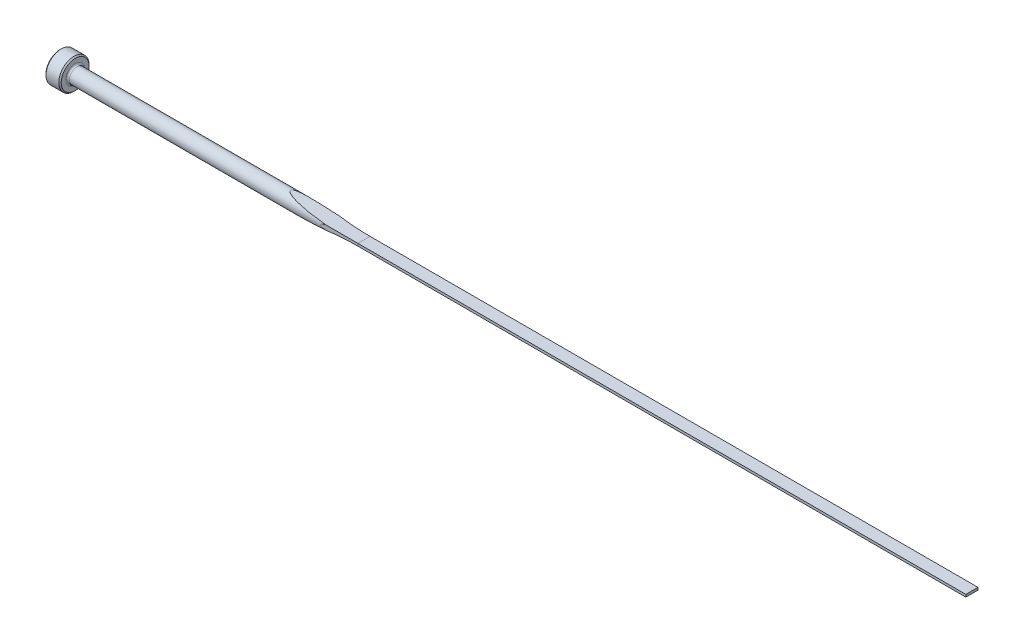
ISO-10303-21;
HEADER;
FILE_DESCRIPTION(('STEP AP214'),'2;1');
FILE_NAME('part.step','',(''),(''),'','','');
FILE_SCHEMA(('AUTOMOTIVE_DESIGN { 1 0 10303 214 1 1 1 1 }'));
ENDSEC;
DATA;
#1=APPLICATION_CONTEXT('core data for automotive mechanical design processes');
#2=APPLICATION_PROTOCOL_DEFINITION('international standard','automotive_design',2000,#1);
#3=PRODUCT_CONTEXT('',#1,'mechanical');
#4=PRODUCT('Part','Part','',(#3));
#5=PRODUCT_RELATED_PRODUCT_CATEGORY('part','',(#4));
#6=PRODUCT_DEFINITION_FORMATION('','',#4);
#7=PRODUCT_DEFINITION_CONTEXT('part definition',#1,'design');
#8=PRODUCT_DEFINITION('design','',#6,#7);
#9=PRODUCT_DEFINITION_SHAPE('','',#8);
#10=(LENGTH_UNIT() NAMED_UNIT(*) SI_UNIT(.MILLI.,.METRE.));
#11=(NAMED_UNIT(*) PLANE_ANGLE_UNIT() SI_UNIT($,.RADIAN.));
#12=(NAMED_UNIT(*) SI_UNIT($,.STERADIAN.) SOLID_ANGLE_UNIT());
#13=UNCERTAINTY_MEASURE_WITH_UNIT(LENGTH_MEASURE(1.E-05),#10,'distance_accuracy_value','');
#14=(GEOMETRIC_REPRESENTATION_CONTEXT(3) GLOBAL_UNCERTAINTY_ASSIGNED_CONTEXT((#13)) GLOBAL_UNIT_ASSIGNED_CONTEXT((#10,
#11,#12)) REPRESENTATION_CONTEXT('',''));
#15=CARTESIAN_POINT('',(0.,0.,0.));
#16=DIRECTION('',(0.,0.,1.));
#17=DIRECTION('',(1.,0.,0.));
#18=AXIS2_PLACEMENT_3D('',#15,#16,#17);
#19=CARTESIAN_POINT('',(0.,0.,0.));
#20=DIRECTION('',(-1.,0.,0.));
#21=DIRECTION('',(0.,0.,1.));
#22=AXIS2_PLACEMENT_3D('',#19,#20,#21);
#23=CYLINDRICAL_SURFACE('',#22,1.5875);
#24=CARTESIAN_POINT('',(3.556,0.,0.));
#25=DIRECTION('',(-1.,0.,0.));
#26=DIRECTION('',(0.,0.,1.));
#27=AXIS2_PLACEMENT_3D('',#24,#25,#26);
#28=CIRCLE('',#27,1.5875);
#29=CARTESIAN_POINT('',(3.556,0.,1.5875));
#30=VERTEX_POINT('',#29);
#31=EDGE_CURVE('E152',#30,#30,#28,.F.);
#32=ORIENTED_EDGE('',*,*,#31,.T.);
#33=EDGE_LOOP('',(#32));
#34=FACE_BOUND('',#33,.T.);
#35=CARTESIAN_POINT('',(63.5,0.952500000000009,1.26999999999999));
#36=CARTESIAN_POINT('',(63.2359370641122,0.952472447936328,1.26999969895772));
#37=CARTESIAN_POINT('',(62.9718719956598,0.950929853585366,1.27117652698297));
#38=CARTESIAN_POINT('',(62.4437498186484,0.944621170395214,1.27588282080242));
#39=CARTESIAN_POINT('',(62.1796927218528,0.939854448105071,1.27941274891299));
#40=CARTESIAN_POINT('',(61.6503777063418,0.926871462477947,1.28884723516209));
#41=CARTESIAN_POINT('',(61.3851204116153,0.918638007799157,1.29476362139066));
#42=CARTESIAN_POINT('',(60.8548543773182,0.898288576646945,1.30896501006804));
#43=CARTESIAN_POINT('',(60.5898456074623,0.886173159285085,1.31724967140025));
#44=CARTESIAN_POINT('',(60.0601718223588,0.857369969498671,1.33617874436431));
#45=CARTESIAN_POINT('',(59.7955067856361,0.840682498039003,1.34682300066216));
#46=CARTESIAN_POINT('',(59.2665932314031,0.801572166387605,1.37045957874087));
#47=CARTESIAN_POINT('',(59.0023449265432,0.779146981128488,1.38345285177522));
#48=CARTESIAN_POINT('',(58.4751041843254,0.726695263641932,1.41173301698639));
#49=CARTESIAN_POINT('',(58.2121104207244,0.696680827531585,1.42701624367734));
#50=CARTESIAN_POINT('',(57.819006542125,0.642939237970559,1.45160532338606));
#51=CARTESIAN_POINT('',(57.6882488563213,0.623580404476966,1.46007578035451));
#52=CARTESIAN_POINT('',(57.4274086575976,0.580985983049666,1.47754992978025));
#53=CARTESIAN_POINT('',(57.2973260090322,0.557751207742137,1.48655351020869));
#54=CARTESIAN_POINT('',(57.1029417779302,0.518690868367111,1.50043429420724));
#55=CARTESIAN_POINT('',(57.0382079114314,0.504954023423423,1.50512852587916));
#56=CARTESIAN_POINT('',(56.9091163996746,0.475697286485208,1.51463106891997));
#57=CARTESIAN_POINT('',(56.844758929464,0.460176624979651,1.51943942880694));
#58=CARTESIAN_POINT('',(56.7166394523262,0.426797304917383,1.52915077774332));
#59=CARTESIAN_POINT('',(56.6528776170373,0.408937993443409,1.53405379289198));
#60=CARTESIAN_POINT('',(56.5263676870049,0.369981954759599,1.54391773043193));
#61=CARTESIAN_POINT('',(56.4636187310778,0.34888815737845,1.54887859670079));
#62=CARTESIAN_POINT('',(56.3537745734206,0.306832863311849,1.55767690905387));
#63=CARTESIAN_POINT('',(56.3062912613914,0.28687741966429,1.5615197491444));
#64=CARTESIAN_POINT('',(56.2135147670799,0.242118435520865,1.56910131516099));
#65=CARTESIAN_POINT('',(56.1682167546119,0.217326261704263,1.57284026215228));
#66=CARTESIAN_POINT('',(56.1094526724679,0.17621074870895,1.5777311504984));
#67=CARTESIAN_POINT('',(56.0933005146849,0.163830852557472,1.57908035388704));
#68=CARTESIAN_POINT('',(56.0628115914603,0.137009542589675,1.58163476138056));
#69=CARTESIAN_POINT('',(56.0484664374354,0.122578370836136,1.58284062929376));
#70=CARTESIAN_POINT('',(56.0298776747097,0.099325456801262,1.58440687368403));
#71=CARTESIAN_POINT('',(56.0243089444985,0.0915828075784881,1.58487670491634));
#72=CARTESIAN_POINT('',(56.0142247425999,0.0754170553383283,1.58572829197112));
#73=CARTESIAN_POINT('',(56.009709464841,0.0669938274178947,1.58611003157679));
#74=CARTESIAN_POINT('',(56.0020627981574,0.0493687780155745,1.58675692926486));
#75=CARTESIAN_POINT('',(55.9989527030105,0.0401573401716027,1.58702029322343));
#76=CARTESIAN_POINT('',(55.9946485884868,0.021299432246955,1.58738485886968));
#77=CARTESIAN_POINT('',(55.9934494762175,0.0116541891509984,1.58748649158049));
#78=CARTESIAN_POINT('',(55.9931810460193,-0.00627689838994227,1.58750924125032));
#79=CARTESIAN_POINT('',(55.9938309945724,-0.0145593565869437,1.58745415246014));
#80=CARTESIAN_POINT('',(55.996586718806,-0.0308792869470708,1.58722068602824));
#81=CARTESIAN_POINT('',(55.9986943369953,-0.0389164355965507,1.58704215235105));
#82=CARTESIAN_POINT('',(56.0048784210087,-0.0566940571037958,1.58651867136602));
#83=CARTESIAN_POINT('',(56.0093358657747,-0.0662986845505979,1.58614155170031));
#84=CARTESIAN_POINT('',(56.0196912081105,-0.0846844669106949,1.58526650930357));
#85=CARTESIAN_POINT('',(56.0255922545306,-0.0934637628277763,1.5847683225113));
#86=CARTESIAN_POINT('',(56.0434792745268,-0.116928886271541,1.58326042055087));
#87=CARTESIAN_POINT('',(56.0565698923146,-0.130753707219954,1.58215918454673));
#88=CARTESIAN_POINT('',(56.0844713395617,-0.156505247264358,1.57981919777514));
#89=CARTESIAN_POINT('',(56.0992876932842,-0.168425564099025,1.57858000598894));
#90=CARTESIAN_POINT('',(56.1395782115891,-0.197928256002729,1.57522129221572));
#91=CARTESIAN_POINT('',(56.1658878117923,-0.214348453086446,1.57303885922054));
#92=CARTESIAN_POINT('',(56.2198696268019,-0.244796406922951,1.56858667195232));
#93=CARTESIAN_POINT('',(56.2475451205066,-0.258818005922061,1.5663167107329));
#94=CARTESIAN_POINT('',(56.3038496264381,-0.285216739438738,1.56172600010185));
#95=CARTESIAN_POINT('',(56.3324831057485,-0.297584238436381,1.55940503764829));
#96=CARTESIAN_POINT('',(56.3902313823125,-0.320999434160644,1.55475283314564));
#97=CARTESIAN_POINT('',(56.4193455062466,-0.33204882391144,1.55242160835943));
#98=CARTESIAN_POINT('',(56.5167156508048,-0.367120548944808,1.54467408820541));
#99=CARTESIAN_POINT('',(56.5857586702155,-0.388949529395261,1.5392597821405));
#100=CARTESIAN_POINT('',(56.7248495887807,-0.42919515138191,1.52851860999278));
#101=CARTESIAN_POINT('',(56.7948981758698,-0.447609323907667,1.52319180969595));
#102=CARTESIAN_POINT('',(57.0062524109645,-0.49930479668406,1.5073742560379));
#103=CARTESIAN_POINT('',(57.1484583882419,-0.528940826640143,1.497070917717));
#104=CARTESIAN_POINT('',(57.4339343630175,-0.582377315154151,1.47708391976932));
#105=CARTESIAN_POINT('',(57.5772043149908,-0.60617802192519,1.46740023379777));
#106=CARTESIAN_POINT('',(57.8642106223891,-0.649595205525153,1.44870309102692));
#107=CARTESIAN_POINT('',(58.0079460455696,-0.669217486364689,1.43968871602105));
#108=CARTESIAN_POINT('',(58.3632966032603,-0.713812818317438,1.41827252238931));
#109=CARTESIAN_POINT('',(58.575158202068,-0.736984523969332,1.40626275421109));
#110=CARTESIAN_POINT('',(58.9994492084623,-0.778441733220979,1.38373872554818));
#111=CARTESIAN_POINT('',(59.2118786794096,-0.796726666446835,1.37322463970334));
#112=CARTESIAN_POINT('',(59.6372766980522,-0.829463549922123,1.35370227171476));
#113=CARTESIAN_POINT('',(59.8502455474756,-0.843912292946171,1.34469525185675));
#114=CARTESIAN_POINT('',(60.2764363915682,-0.869626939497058,1.32820734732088));
#115=CARTESIAN_POINT('',(60.4896583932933,-0.880892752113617,1.32072650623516));
#116=CARTESIAN_POINT('',(61.1289383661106,-0.910591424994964,1.30060326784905));
#117=CARTESIAN_POINT('',(61.5552599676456,-0.924972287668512,1.29025032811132));
#118=CARTESIAN_POINT('',(62.4080583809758,-0.944949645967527,1.27568360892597));
#119=CARTESIAN_POINT('',(62.8345350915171,-0.950549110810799,1.27146775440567));
#120=CARTESIAN_POINT('',(63.3406819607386,-0.952355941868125,1.27010705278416));
#121=CARTESIAN_POINT('',(63.4203412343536,-0.952498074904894,1.26999997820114));
#122=CARTESIAN_POINT('',(63.5,-0.95250000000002,1.26999999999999));
#123=B_SPLINE_CURVE_WITH_KNOTS('',3,(#35,#36,#37,#38,#39,#40,#41,#42,#43,#44,#45,#46,#47,#48,
#49,#50,#51,#52,#53,#54,#55,#56,#57,#58,#59,#60,#61,#62,#63,#64,#65,#66,#67,#68,#69,#70,#71,#72,
#73,#74,#75,#76,#77,#78,#79,#80,#81,#82,#83,#84,#85,#86,#87,#88,#89,#90,#91,#92,#93,#94,#95,#96,
#97,#98,#99,#100,#101,#102,#103,#104,#105,#106,#107,#108,#109,#110,#111,#112,#113,#114,#115,
#116,#117,#118,#119,#120,#121,#122),.UNSPECIFIED.,.F.,.F.,(4,2,2,2,2,2,2,2,2,2,2,2,2,2,2,2,2,2,
2,2,2,2,2,2,2,2,2,2,2,2,2,2,2,2,2,2,2,2,2,2,2,2,2,4),(0.,0.792185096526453,1.58452588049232,
2.38084299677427,3.17704547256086,3.97319554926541,4.76966875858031,5.56488042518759,
5.96220645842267,6.359449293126,6.55845704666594,6.75755097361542,6.95670060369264,
7.15567089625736,7.31055958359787,7.46508856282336,7.52618112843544,7.58697872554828,
7.61556379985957,7.64415413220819,7.67316426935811,7.70209696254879,7.7268810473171,
7.75169651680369,7.78330369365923,7.81498043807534,7.87187149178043,7.92894994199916,
8.02197622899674,8.11523786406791,8.20902108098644,8.30268251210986,8.52035294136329,
8.73818014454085,9.17480519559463,9.61141167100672,10.0474076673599,10.6877093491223,
11.3280857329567,11.9689958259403,12.6099242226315,13.8898257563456,15.1692944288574,
15.4082719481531),.UNSPECIFIED.);
#124=CARTESIAN_POINT('',(56.9855359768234,0.493006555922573,1.50900655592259));
#125=VERTEX_POINT('',#124);
#126=CARTESIAN_POINT('',(56.9855359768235,-0.493006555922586,1.50900655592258));
#127=VERTEX_POINT('',#126);
#128=EDGE_CURVE('E155',#125,#127,#123,.T.);
#129=ORIENTED_EDGE('',*,*,#128,.F.);
#130=CARTESIAN_POINT('',(63.5,0.25399999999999,1.56704826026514));
#131=CARTESIAN_POINT('',(63.2354167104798,0.253999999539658,1.56704393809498));
#132=CARTESIAN_POINT('',(62.9708348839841,0.255181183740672,1.56685739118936));
#133=CARTESIAN_POINT('',(62.4416940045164,0.259905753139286,1.5660821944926));
#134=CARTESIAN_POINT('',(62.1771349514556,0.263449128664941,1.56549354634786));
#135=CARTESIAN_POINT('',(61.3832839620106,0.277626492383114,1.56306725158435));
#136=CARTESIAN_POINT('',(60.8540527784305,0.291807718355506,1.56056919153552));
#137=CARTESIAN_POINT('',(59.7955441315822,0.329635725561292,1.55301926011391));
#138=CARTESIAN_POINT('',(59.2662669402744,0.353289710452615,1.54796544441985));
#139=CARTESIAN_POINT('',(58.2082412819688,0.410053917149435,1.53390598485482));
#140=CARTESIAN_POINT('',(57.6794928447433,0.443164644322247,1.52490012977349));
#141=CARTESIAN_POINT('',(56.6228881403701,0.518816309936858,1.50085888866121));
#142=CARTESIAN_POINT('',(56.0950317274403,0.561355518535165,1.48582460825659));
#143=CARTESIAN_POINT('',(55.3041604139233,0.632204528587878,1.4564052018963));
#144=CARTESIAN_POINT('',(55.0406987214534,0.656993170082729,1.44545460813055));
#145=CARTESIAN_POINT('',(54.5141407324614,0.708907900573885,1.42071692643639));
#146=CARTESIAN_POINT('',(54.2510444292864,0.736033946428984,1.40692989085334));
#147=CARTESIAN_POINT('',(53.7252867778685,0.792611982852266,1.37585048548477));
#148=CARTESIAN_POINT('',(53.4626254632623,0.82206414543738,1.35855785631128));
#149=CARTESIAN_POINT('',(52.9378714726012,0.883273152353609,1.3195851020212));
#150=CARTESIAN_POINT('',(52.6757788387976,0.915030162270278,1.29790466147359));
#151=CARTESIAN_POINT('',(52.1522989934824,0.980822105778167,1.24893046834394));
#152=CARTESIAN_POINT('',(51.8909120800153,1.01485788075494,1.22163463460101));
#153=CARTESIAN_POINT('',(51.3693255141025,1.08512958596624,1.15968383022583));
#154=CARTESIAN_POINT('',(51.1091256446,1.12136509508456,1.12503026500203));
#155=CARTESIAN_POINT('',(50.7200295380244,1.17730095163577,1.06529471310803));
#156=CARTESIAN_POINT('',(50.5904295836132,1.19622557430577,1.04407049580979));
#157=CARTESIAN_POINT('',(50.3318326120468,1.23456842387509,0.998444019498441));
#158=CARTESIAN_POINT('',(50.2028357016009,1.25398673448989,0.974041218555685));
#159=CARTESIAN_POINT('',(49.9458948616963,1.2932402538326,0.921284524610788));
#160=CARTESIAN_POINT('',(49.8179497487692,1.31307486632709,0.892935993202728));
#161=CARTESIAN_POINT('',(49.5633992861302,1.35310175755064,0.831049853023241));
#162=CARTESIAN_POINT('',(49.4367933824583,1.37329387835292,0.797514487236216));
#163=CARTESIAN_POINT('',(49.2484123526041,1.40375034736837,0.741677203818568));
#164=CARTESIAN_POINT('',(49.1858135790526,1.41394047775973,0.722120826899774));
#165=CARTESIAN_POINT('',(49.0613824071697,1.4343312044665,0.680723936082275));
#166=CARTESIAN_POINT('',(48.9995498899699,1.44453179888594,0.65888378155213));
#167=CARTESIAN_POINT('',(48.8766774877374,1.4649338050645,0.612192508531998));
#168=CARTESIAN_POINT('',(48.8156425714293,1.47513500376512,0.587327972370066));
#169=CARTESIAN_POINT('',(48.6953456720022,1.49536705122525,0.5337173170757));
#170=CARTESIAN_POINT('',(48.6360817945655,1.50539807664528,0.504975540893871));
#171=CARTESIAN_POINT('',(48.5195843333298,1.52523391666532,0.441542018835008));
#172=CARTESIAN_POINT('',(48.462386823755,1.53503414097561,0.406778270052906));
#173=CARTESIAN_POINT('',(48.3814285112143,1.54897987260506,0.348148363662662));
#174=CARTESIAN_POINT('',(48.3553410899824,1.55348657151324,0.32761677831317));
#175=CARTESIAN_POINT('',(48.3056135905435,1.56209826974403,0.283739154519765));
#176=CARTESIAN_POINT('',(48.2819667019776,1.56620438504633,0.260401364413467));
#177=CARTESIAN_POINT('',(48.2457792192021,1.57250098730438,0.218373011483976));
#178=CARTESIAN_POINT('',(48.2321397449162,1.57487805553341,0.200668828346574));
#179=CARTESIAN_POINT('',(48.2075101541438,1.57917536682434,0.163435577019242));
#180=CARTESIAN_POINT('',(48.1965153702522,1.58109641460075,0.143909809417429));
#181=CARTESIAN_POINT('',(48.1805975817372,1.58387976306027,0.108236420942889));
#182=CARTESIAN_POINT('',(48.1748427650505,1.58488686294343,0.0924766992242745));
#183=CARTESIAN_POINT('',(48.1659718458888,1.58643978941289,0.0602068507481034));
#184=CARTESIAN_POINT('',(48.1628525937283,1.58698616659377,0.043697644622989));
#185=CARTESIAN_POINT('',(48.1596051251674,1.58755500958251,0.0102775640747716));
#186=CARTESIAN_POINT('',(48.1594933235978,1.58757460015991,-0.00663501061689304));
#187=CARTESIAN_POINT('',(48.1623168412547,1.58708000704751,-0.0401958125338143));
#188=CARTESIAN_POINT('',(48.1652540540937,1.58656549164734,-0.0568438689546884));
#189=CARTESIAN_POINT('',(48.1745315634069,1.58494129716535,-0.0920756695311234));
#190=CARTESIAN_POINT('',(48.181352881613,1.5837475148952,-0.110526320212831));
#191=CARTESIAN_POINT('',(48.1978291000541,1.58086692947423,-0.146067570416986));
#192=CARTESIAN_POINT('',(48.2074896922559,1.57917913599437,-0.163155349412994));
#193=CARTESIAN_POINT('',(48.2358163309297,1.57423628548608,-0.206592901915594));
#194=CARTESIAN_POINT('',(48.2562524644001,1.57067592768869,-0.231736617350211));
#195=CARTESIAN_POINT('',(48.3003999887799,1.56300349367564,-0.278830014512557));
#196=CARTESIAN_POINT('',(48.3241209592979,1.55888980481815,-0.300769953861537));
#197=CARTESIAN_POINT('',(48.3844827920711,1.54844971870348,-0.351269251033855));
#198=CARTESIAN_POINT('',(48.4222072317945,1.54194769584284,-0.378479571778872));
#199=CARTESIAN_POINT('',(48.5000174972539,1.52859216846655,-0.42923938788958));
#200=CARTESIAN_POINT('',(48.5401084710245,1.52173790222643,-0.452780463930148));
#201=CARTESIAN_POINT('',(48.6219734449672,1.50780179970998,-0.49722701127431));
#202=CARTESIAN_POINT('',(48.6637556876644,1.50071889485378,-0.518116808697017));
#203=CARTESIAN_POINT('',(48.7482557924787,1.486458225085,-0.557707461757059));
#204=CARTESIAN_POINT('',(48.790972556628,1.47928057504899,-0.576410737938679));
#205=CARTESIAN_POINT('',(48.9204139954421,1.45762991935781,-0.630059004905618));
#206=CARTESIAN_POINT('',(49.0081926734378,1.44307961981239,-0.662421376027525));
#207=CARTESIAN_POINT('',(49.1853696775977,1.41398949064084,-0.722418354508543));
#208=CARTESIAN_POINT('',(49.2747690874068,1.39944967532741,-0.750049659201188));
#209=CARTESIAN_POINT('',(49.45480524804,1.37045465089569,-0.801805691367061));
#210=CARTESIAN_POINT('',(49.5454443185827,1.35599970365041,-0.825922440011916));
#211=CARTESIAN_POINT('',(49.7274555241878,1.32726423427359,-0.871345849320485));
#212=CARTESIAN_POINT('',(49.8188277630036,1.31298373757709,-0.892652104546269));
#213=CARTESIAN_POINT('',(50.0939221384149,1.27043207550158,-0.953213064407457));
#214=CARTESIAN_POINT('',(50.2784450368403,1.24247924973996,-0.989061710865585));
#215=CARTESIAN_POINT('',(50.5560192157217,1.2013302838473,-1.03798032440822));
#216=CARTESIAN_POINT('',(50.6486097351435,1.18775334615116,-1.05346821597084));
#217=CARTESIAN_POINT('',(50.8340531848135,1.16086069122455,-1.08303292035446));
#218=CARTESIAN_POINT('',(50.9269061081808,1.14754496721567,-1.09710976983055));
#219=CARTESIAN_POINT('',(51.2041473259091,1.10823550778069,-1.13726394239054));
#220=CARTESIAN_POINT('',(51.3888518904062,1.08263726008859,-1.16154571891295));
#221=CARTESIAN_POINT('',(51.7588768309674,1.03254462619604,-1.20628674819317));
#222=CARTESIAN_POINT('',(51.9441972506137,1.00805031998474,-1.22674572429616));
#223=CARTESIAN_POINT('',(52.5009342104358,0.93625472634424,-1.28348648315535));
#224=CARTESIAN_POINT('',(52.8730445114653,0.890652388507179,-1.31512095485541));
#225=CARTESIAN_POINT('',(53.618946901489,0.804036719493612,-1.36977266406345));
#226=CARTESIAN_POINT('',(53.9927406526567,0.763030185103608,-1.39277725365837));
#227=CARTESIAN_POINT('',(54.7410974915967,0.685739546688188,-1.43241145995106));
#228=CARTESIAN_POINT('',(55.1156604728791,0.649454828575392,-1.44904190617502));
#229=CARTESIAN_POINT('',(55.8649854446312,0.581668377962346,-1.47755349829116));
#230=CARTESIAN_POINT('',(56.2397467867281,0.550161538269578,-1.4894397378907));
#231=CARTESIAN_POINT('',(56.9897437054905,0.491899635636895,-1.50968238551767));
#232=CARTESIAN_POINT('',(57.3649792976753,0.465144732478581,-1.51803867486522));
#233=CARTESIAN_POINT('',(58.1155624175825,0.416413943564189,-1.53212186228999));
#234=CARTESIAN_POINT('',(58.4909097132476,0.394434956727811,-1.53785046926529));
#235=CARTESIAN_POINT('',(59.2418774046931,0.355240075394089,-1.54737437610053));
#236=CARTESIAN_POINT('',(59.6174978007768,0.33802418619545,-1.55116967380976));
#237=CARTESIAN_POINT('',(60.285412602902,0.311656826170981,-1.55665139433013));
#238=CARTESIAN_POINT('',(60.5776680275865,0.301563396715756,-1.55861906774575));
#239=CARTESIAN_POINT('',(61.1622964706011,0.284260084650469,-1.56186740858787));
#240=CARTESIAN_POINT('',(61.4546694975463,0.277050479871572,-1.56314800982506));
#241=CARTESIAN_POINT('',(62.0392018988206,0.265522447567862,-1.56514858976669));
#242=CARTESIAN_POINT('',(62.3313612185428,0.261201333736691,-1.56586908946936));
#243=CARTESIAN_POINT('',(62.9156803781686,0.25544022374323,-1.56681450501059));
#244=CARTESIAN_POINT('',(63.2078402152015,0.253999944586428,-1.56703946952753));
#245=CARTESIAN_POINT('',(63.5,0.253999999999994,-1.56704826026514));
#246=B_SPLINE_CURVE_WITH_KNOTS('',3,(#130,#131,#132,#133,#134,#135,#136,#137,#138,#139,#140,
#141,#142,#143,#144,#145,#146,#147,#148,#149,#150,#151,#152,#153,#154,#155,#156,#157,#158,#159,
#160,#161,#162,#163,#164,#165,#166,#167,#168,#169,#170,#171,#172,#173,#174,#175,#176,#177,#178,
#179,#180,#181,#182,#183,#184,#185,#186,#187,#188,#189,#190,#191,#192,#193,#194,#195,#196,#197,
#198,#199,#200,#201,#202,#203,#204,#205,#206,#207,#208,#209,#210,#211,#212,#213,#214,#215,#216,
#217,#218,#219,#220,#221,#222,#223,#224,#225,#226,#227,#228,#229,#230,#231,#232,#233,#234,#235,
#236,#237,#238,#239,#240,#241,#242,#243,#244,#245),.UNSPECIFIED.,.F.,.F.,(4,2,2,2,2,2,2,2,2,2,2,
2,2,2,2,2,2,2,2,2,2,2,2,2,2,2,2,2,2,2,2,2,2,2,2,2,2,2,2,2,2,2,2,2,2,2,2,2,2,2,2,2,2,2,2,2,2,4),
(0.,0.793744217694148,1.58748518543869,3.17567076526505,4.76506639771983,6.35454698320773,
7.9437361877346,8.73827121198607,9.53279157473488,10.3273707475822,11.1220070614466,
11.9169384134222,12.711718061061,13.1097370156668,13.5078239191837,13.9053750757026,
14.3027547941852,14.5018296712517,14.7008732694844,14.9008345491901,15.1005736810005,
15.3028906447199,15.4032699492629,15.5033611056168,15.5706233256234,15.6377659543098,
15.6879966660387,15.7381672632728,15.7886116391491,15.8390873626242,15.8978807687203,
15.9567928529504,16.0540285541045,16.1515540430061,16.2920982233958,16.4329602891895,
16.5746197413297,16.7161208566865,16.9999283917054,17.2839332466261,17.5685731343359,
17.8532540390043,18.4231718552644,18.7077280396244,18.9922768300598,19.5563501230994,
20.1204642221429,21.248942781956,22.3790688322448,23.5090477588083,24.6378101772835,
25.7666105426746,26.8946757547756,28.022742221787,28.9000367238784,29.777415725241,
30.6539776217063,31.5304534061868),.UNSPECIFIED.);
#247=CARTESIAN_POINT('',(56.9855359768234,0.493006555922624,-1.50900655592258));
#248=VERTEX_POINT('',#247);
#249=EDGE_CURVE('E105',#125,#248,#246,.T.);
#250=ORIENTED_EDGE('',*,*,#249,.T.);
#251=CARTESIAN_POINT('',(63.5,0.952500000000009,-1.26999999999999));
#252=CARTESIAN_POINT('',(63.2359370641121,0.952472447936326,-1.26999969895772));
#253=CARTESIAN_POINT('',(62.9718719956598,0.950929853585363,-1.27117652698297));
#254=CARTESIAN_POINT('',(62.4437498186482,0.944621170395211,-1.27588282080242));
#255=CARTESIAN_POINT('',(62.1796927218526,0.939854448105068,-1.279412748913));
#256=CARTESIAN_POINT('',(61.6503777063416,0.926871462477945,-1.28884723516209));
#257=CARTESIAN_POINT('',(61.3851204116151,0.918638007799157,-1.29476362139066));
#258=CARTESIAN_POINT('',(60.8548543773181,0.898288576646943,-1.30896501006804));
#259=CARTESIAN_POINT('',(60.5898456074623,0.886173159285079,-1.31724967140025));
#260=CARTESIAN_POINT('',(60.0601718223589,0.857369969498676,-1.33617874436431));
#261=CARTESIAN_POINT('',(59.7955067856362,0.840682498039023,-1.34682300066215));
#262=CARTESIAN_POINT('',(59.2665932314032,0.801572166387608,-1.37045957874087));
#263=CARTESIAN_POINT('',(59.0023449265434,0.779146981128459,-1.38345285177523));
#264=CARTESIAN_POINT('',(58.4751041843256,0.726695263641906,-1.4117330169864));
#265=CARTESIAN_POINT('',(58.2121104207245,0.696680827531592,-1.42701624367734));
#266=CARTESIAN_POINT('',(57.819006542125,0.642939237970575,-1.45160532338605));
#267=CARTESIAN_POINT('',(57.6882488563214,0.623580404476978,-1.4600757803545));
#268=CARTESIAN_POINT('',(57.4274086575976,0.580985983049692,-1.47754992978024));
#269=CARTESIAN_POINT('',(57.2973260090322,0.557751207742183,-1.48655351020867));
#270=CARTESIAN_POINT('',(57.1029417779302,0.518690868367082,-1.50043429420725));
#271=CARTESIAN_POINT('',(57.0382079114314,0.50495402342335,-1.50512852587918));
#272=CARTESIAN_POINT('',(56.9091163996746,0.475697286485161,-1.51463106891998));
#273=CARTESIAN_POINT('',(56.8447589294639,0.460176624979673,-1.51943942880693));
#274=CARTESIAN_POINT('',(56.716639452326,0.426797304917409,-1.52915077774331));
#275=CARTESIAN_POINT('',(56.6528776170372,0.40893799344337,-1.53405379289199));
#276=CARTESIAN_POINT('',(56.5263676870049,0.369981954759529,-1.54391773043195));
#277=CARTESIAN_POINT('',(56.4636187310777,0.348888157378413,-1.5488785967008));
#278=CARTESIAN_POINT('',(56.3537745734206,0.306832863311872,-1.55767690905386));
#279=CARTESIAN_POINT('',(56.3062912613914,0.286877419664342,-1.56151974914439));
#280=CARTESIAN_POINT('',(56.2135147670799,0.242118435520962,-1.56910131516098));
#281=CARTESIAN_POINT('',(56.1682167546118,0.21732626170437,-1.57284026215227));
#282=CARTESIAN_POINT('',(56.1094526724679,0.176210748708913,-1.5777311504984));
#283=CARTESIAN_POINT('',(56.0933005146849,0.163830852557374,-1.57908035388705));
#284=CARTESIAN_POINT('',(56.0628115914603,0.137009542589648,-1.58163476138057));
#285=CARTESIAN_POINT('',(56.0484664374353,0.122578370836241,-1.58284062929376));
#286=CARTESIAN_POINT('',(56.0298776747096,0.0993254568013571,-1.58440687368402));
#287=CARTESIAN_POINT('',(56.0243089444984,0.0915828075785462,-1.58487670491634));
#288=CARTESIAN_POINT('',(56.0142247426,0.0754170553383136,-1.58572829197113));
#289=CARTESIAN_POINT('',(56.0097094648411,0.0669938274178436,-1.5861100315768));
#290=CARTESIAN_POINT('',(56.0020627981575,0.04936877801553,-1.58675692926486));
#291=CARTESIAN_POINT('',(55.9989527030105,0.0401573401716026,-1.58702029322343));
#292=CARTESIAN_POINT('',(55.9946485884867,0.0212994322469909,-1.58738485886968));
#293=CARTESIAN_POINT('',(55.9934494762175,0.0116541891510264,-1.58748649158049));
#294=CARTESIAN_POINT('',(55.9931810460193,-0.00627689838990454,-1.58750924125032));
#295=CARTESIAN_POINT('',(55.9938309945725,-0.0145593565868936,-1.58745415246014));
#296=CARTESIAN_POINT('',(55.9965867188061,-0.0308792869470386,-1.58722068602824));
#297=CARTESIAN_POINT('',(55.9986943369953,-0.0389164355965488,-1.58704215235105));
#298=CARTESIAN_POINT('',(56.0048784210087,-0.0566940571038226,-1.58651867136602));
#299=CARTESIAN_POINT('',(56.0093358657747,-0.0662986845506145,-1.58614155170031));
#300=CARTESIAN_POINT('',(56.0196912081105,-0.0846844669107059,-1.58526650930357));
#301=CARTESIAN_POINT('',(56.0255922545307,-0.0934637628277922,-1.5847683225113));
#302=CARTESIAN_POINT('',(56.0434792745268,-0.116928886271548,-1.58326042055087));
#303=CARTESIAN_POINT('',(56.0565698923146,-0.130753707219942,-1.58215918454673));
#304=CARTESIAN_POINT('',(56.0844713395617,-0.156505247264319,-1.57981919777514));
#305=CARTESIAN_POINT('',(56.0992876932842,-0.168425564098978,-1.57858000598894));
#306=CARTESIAN_POINT('',(56.139578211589,-0.19792825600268,-1.57522129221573));
#307=CARTESIAN_POINT('',(56.1658878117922,-0.214348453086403,-1.57303885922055));
#308=CARTESIAN_POINT('',(56.2198696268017,-0.244796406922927,-1.56858667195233));
#309=CARTESIAN_POINT('',(56.2475451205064,-0.258818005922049,-1.5663167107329));
#310=CARTESIAN_POINT('',(56.3038496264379,-0.285216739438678,-1.56172600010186));
#311=CARTESIAN_POINT('',(56.3324831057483,-0.297584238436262,-1.55940503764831));
#312=CARTESIAN_POINT('',(56.3902313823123,-0.320999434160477,-1.55475283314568));
#313=CARTESIAN_POINT('',(56.4193455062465,-0.332048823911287,-1.55242160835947));
#314=CARTESIAN_POINT('',(56.5167156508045,-0.367120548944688,-1.54467408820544));
#315=CARTESIAN_POINT('',(56.5857586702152,-0.38894952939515,-1.53925978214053));
#316=CARTESIAN_POINT('',(56.7248495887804,-0.429195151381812,-1.52851860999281));
#317=CARTESIAN_POINT('',(56.7948981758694,-0.447609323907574,-1.52319180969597));
#318=CARTESIAN_POINT('',(57.006252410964,-0.49930479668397,-1.50737425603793));
#319=CARTESIAN_POINT('',(57.1484583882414,-0.528940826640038,-1.49707091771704));
#320=CARTESIAN_POINT('',(57.4339343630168,-0.582377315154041,-1.47708391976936));
#321=CARTESIAN_POINT('',(57.5772043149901,-0.606178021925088,-1.46740023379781));
#322=CARTESIAN_POINT('',(57.8642106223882,-0.649595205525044,-1.44870309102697));
#323=CARTESIAN_POINT('',(58.0079460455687,-0.669217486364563,-1.43968871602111));
#324=CARTESIAN_POINT('',(58.3632966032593,-0.713812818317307,-1.41827252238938));
#325=CARTESIAN_POINT('',(58.5751582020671,-0.736984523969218,-1.40626275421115));
#326=CARTESIAN_POINT('',(58.9994492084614,-0.778441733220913,-1.38373872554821));
#327=CARTESIAN_POINT('',(59.2118786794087,-0.796726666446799,-1.37322463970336));
#328=CARTESIAN_POINT('',(59.6372766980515,-0.829463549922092,-1.35370227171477));
#329=CARTESIAN_POINT('',(59.8502455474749,-0.843912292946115,-1.34469525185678));
#330=CARTESIAN_POINT('',(60.2764363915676,-0.869626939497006,-1.32820734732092));
#331=CARTESIAN_POINT('',(60.4896583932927,-0.880892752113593,-1.32072650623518));
#332=CARTESIAN_POINT('',(61.1289383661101,-0.910591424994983,-1.30060326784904));
#333=CARTESIAN_POINT('',(61.5552599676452,-0.924972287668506,-1.29025032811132));
#334=CARTESIAN_POINT('',(62.4080583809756,-0.944949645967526,-1.27568360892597));
#335=CARTESIAN_POINT('',(62.8345350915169,-0.950549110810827,-1.27146775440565));
#336=CARTESIAN_POINT('',(63.3406819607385,-0.952355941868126,-1.27010705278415));
#337=CARTESIAN_POINT('',(63.4203412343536,-0.95249807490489,-1.26999997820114));
#338=CARTESIAN_POINT('',(63.5,-0.952500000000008,-1.27));
#339=B_SPLINE_CURVE_WITH_KNOTS('',3,(#251,#252,#253,#254,#255,#256,#257,#258,#259,#260,#261,
#262,#263,#264,#265,#266,#267,#268,#269,#270,#271,#272,#273,#274,#275,#276,#277,#278,#279,#280,
#281,#282,#283,#284,#285,#286,#287,#288,#289,#290,#291,#292,#293,#294,#295,#296,#297,#298,#299,
#300,#301,#302,#303,#304,#305,#306,#307,#308,#309,#310,#311,#312,#313,#314,#315,#316,#317,#318,
#319,#320,#321,#322,#323,#324,#325,#326,#327,#328,#329,#330,#331,#332,#333,#334,#335,#336,#337,
#338),.UNSPECIFIED.,.F.,.F.,(4,2,2,2,2,2,2,2,2,2,2,2,2,2,2,2,2,2,2,2,2,2,2,2,2,2,2,2,2,2,2,2,2,
2,2,2,2,2,2,2,2,2,2,4),(0.,0.792185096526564,1.58452588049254,2.38084299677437,3.17704547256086,
3.97319554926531,4.7696687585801,5.56488042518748,5.96220645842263,6.35944929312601,
6.558457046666,6.75755097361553,6.95670060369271,7.15567089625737,7.3105595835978,
7.46508856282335,7.52618112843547,7.58697872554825,7.61556379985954,7.64415413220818,
7.6731642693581,7.70209696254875,7.72688104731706,7.75169651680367,7.78330369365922,
7.81498043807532,7.87187149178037,7.92894994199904,8.02197622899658,8.1152378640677,
8.20902108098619,8.30268251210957,8.52035294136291,8.73818014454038,9.17480519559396,
9.61141167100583,10.0474076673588,10.6877093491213,11.3280857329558,11.9689958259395,
12.6099242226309,13.8898257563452,15.1692944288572,15.408271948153),.UNSPECIFIED.);
#340=CARTESIAN_POINT('',(56.9855359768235,-0.493006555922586,-1.50900655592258));
#341=VERTEX_POINT('',#340);
#342=EDGE_CURVE('E174',#248,#341,#339,.T.);
#343=ORIENTED_EDGE('',*,*,#342,.T.);
#344=CARTESIAN_POINT('',(63.5,-0.25399999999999,1.56704826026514));
#345=CARTESIAN_POINT('',(63.2354167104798,-0.253999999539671,1.56704393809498));
#346=CARTESIAN_POINT('',(62.9708348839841,-0.255181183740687,1.56685739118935));
#347=CARTESIAN_POINT('',(62.4416940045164,-0.259905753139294,1.5660821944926));
#348=CARTESIAN_POINT('',(62.1771349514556,-0.263449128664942,1.56549354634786));
#349=CARTESIAN_POINT('',(61.3832839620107,-0.277626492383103,1.56306725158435));
#350=CARTESIAN_POINT('',(60.8540527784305,-0.291807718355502,1.56056919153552));
#351=CARTESIAN_POINT('',(59.7955441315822,-0.329635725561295,1.55301926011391));
#352=CARTESIAN_POINT('',(59.2662669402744,-0.353289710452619,1.54796544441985));
#353=CARTESIAN_POINT('',(58.2082412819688,-0.410053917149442,1.53390598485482));
#354=CARTESIAN_POINT('',(57.6794928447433,-0.443164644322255,1.52490012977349));
#355=CARTESIAN_POINT('',(56.6228881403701,-0.518816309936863,1.50085888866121));
#356=CARTESIAN_POINT('',(56.0950317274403,-0.561355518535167,1.48582460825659));
#357=CARTESIAN_POINT('',(55.3041604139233,-0.632204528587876,1.4564052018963));
#358=CARTESIAN_POINT('',(55.0406987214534,-0.656993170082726,1.44545460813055));
#359=CARTESIAN_POINT('',(54.5141407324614,-0.708907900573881,1.42071692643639));
#360=CARTESIAN_POINT('',(54.2510444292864,-0.736033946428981,1.40692989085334));
#361=CARTESIAN_POINT('',(53.7252867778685,-0.792611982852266,1.37585048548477));
#362=CARTESIAN_POINT('',(53.4626254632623,-0.822064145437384,1.35855785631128));
#363=CARTESIAN_POINT('',(52.9378714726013,-0.88327315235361,1.3195851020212));
#364=CARTESIAN_POINT('',(52.6757788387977,-0.915030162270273,1.29790466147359));
#365=CARTESIAN_POINT('',(52.1522989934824,-0.980822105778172,1.24893046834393));
#366=CARTESIAN_POINT('',(51.8909120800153,-1.01485788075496,1.22163463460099));
#367=CARTESIAN_POINT('',(51.3693255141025,-1.08512958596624,1.15968383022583));
#368=CARTESIAN_POINT('',(51.1091256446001,-1.12136509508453,1.12503026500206));
#369=CARTESIAN_POINT('',(50.7200295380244,-1.17730095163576,1.06529471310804));
#370=CARTESIAN_POINT('',(50.5904295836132,-1.19622557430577,1.04407049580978));
#371=CARTESIAN_POINT('',(50.3318326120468,-1.23456842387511,0.998444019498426));
#372=CARTESIAN_POINT('',(50.2028357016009,-1.2539867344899,0.974041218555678));
#373=CARTESIAN_POINT('',(49.9458948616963,-1.29324025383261,0.921284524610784));
#374=CARTESIAN_POINT('',(49.8179497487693,-1.3130748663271,0.89293599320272));
#375=CARTESIAN_POINT('',(49.5633992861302,-1.35310175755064,0.831049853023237));
#376=CARTESIAN_POINT('',(49.4367933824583,-1.37329387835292,0.797514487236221));
#377=CARTESIAN_POINT('',(49.2484123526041,-1.40375034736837,0.741677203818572));
#378=CARTESIAN_POINT('',(49.1858135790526,-1.41394047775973,0.722120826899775));
#379=CARTESIAN_POINT('',(49.0613824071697,-1.43433120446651,0.680723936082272));
#380=CARTESIAN_POINT('',(48.99954988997,-1.44453179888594,0.658883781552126));
#381=CARTESIAN_POINT('',(48.8766774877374,-1.46493380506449,0.612192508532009));
#382=CARTESIAN_POINT('',(48.8156425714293,-1.47513500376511,0.587327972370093));
#383=CARTESIAN_POINT('',(48.6953456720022,-1.49536705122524,0.533717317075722));
#384=CARTESIAN_POINT('',(48.6360817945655,-1.50539807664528,0.504975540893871));
#385=CARTESIAN_POINT('',(48.5195843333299,-1.52523391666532,0.441542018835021));
#386=CARTESIAN_POINT('',(48.462386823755,-1.53503414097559,0.406778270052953));
#387=CARTESIAN_POINT('',(48.3814285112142,-1.54897987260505,0.348148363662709));
#388=CARTESIAN_POINT('',(48.3553410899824,-1.55348657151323,0.32761677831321));
#389=CARTESIAN_POINT('',(48.3056135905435,-1.56209826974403,0.283739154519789));
#390=CARTESIAN_POINT('',(48.2819667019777,-1.56620438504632,0.260401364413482));
#391=CARTESIAN_POINT('',(48.2457792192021,-1.57250098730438,0.218373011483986));
#392=CARTESIAN_POINT('',(48.2321397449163,-1.57487805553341,0.200668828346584));
#393=CARTESIAN_POINT('',(48.2075101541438,-1.57917536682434,0.163435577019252));
#394=CARTESIAN_POINT('',(48.1965153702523,-1.58109641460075,0.143909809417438));
#395=CARTESIAN_POINT('',(48.1805975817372,-1.58387976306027,0.108236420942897));
#396=CARTESIAN_POINT('',(48.1748427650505,-1.58488686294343,0.0924766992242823));
#397=CARTESIAN_POINT('',(48.1659718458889,-1.58643978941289,0.0602068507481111));
#398=CARTESIAN_POINT('',(48.1628525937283,-1.58698616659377,0.0436976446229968));
#399=CARTESIAN_POINT('',(48.1596051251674,-1.58755500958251,0.0102775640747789));
#400=CARTESIAN_POINT('',(48.1594933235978,-1.58757460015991,-0.00663501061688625));
#401=CARTESIAN_POINT('',(48.1623168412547,-1.58708000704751,-0.0401958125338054));
#402=CARTESIAN_POINT('',(48.1652540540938,-1.58656549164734,-0.0568438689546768));
#403=CARTESIAN_POINT('',(48.1745315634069,-1.58494129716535,-0.0920756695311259));
#404=CARTESIAN_POINT('',(48.181352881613,-1.5837475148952,-0.110526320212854));
#405=CARTESIAN_POINT('',(48.1978291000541,-1.58086692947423,-0.146067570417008));
#406=CARTESIAN_POINT('',(48.2074896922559,-1.57917913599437,-0.163155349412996));
#407=CARTESIAN_POINT('',(48.2358163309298,-1.57423628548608,-0.206592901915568));
#408=CARTESIAN_POINT('',(48.2562524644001,-1.57067592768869,-0.231736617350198));
#409=CARTESIAN_POINT('',(48.3003999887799,-1.56300349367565,-0.278830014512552));
#410=CARTESIAN_POINT('',(48.3241209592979,-1.55888980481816,-0.300769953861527));
#411=CARTESIAN_POINT('',(48.3844827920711,-1.54844971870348,-0.351269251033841));
#412=CARTESIAN_POINT('',(48.4222072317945,-1.54194769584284,-0.378479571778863));
#413=CARTESIAN_POINT('',(48.5000174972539,-1.52859216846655,-0.429239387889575));
#414=CARTESIAN_POINT('',(48.5401084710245,-1.52173790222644,-0.452780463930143));
#415=CARTESIAN_POINT('',(48.6219734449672,-1.50780179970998,-0.497227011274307));
#416=CARTESIAN_POINT('',(48.6637556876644,-1.50071889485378,-0.518116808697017));
#417=CARTESIAN_POINT('',(48.7482557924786,-1.486458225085,-0.557707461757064));
#418=CARTESIAN_POINT('',(48.790972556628,-1.47928057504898,-0.576410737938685));
#419=CARTESIAN_POINT('',(48.9204139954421,-1.4576299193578,-0.630059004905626));
#420=CARTESIAN_POINT('',(49.0081926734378,-1.44307961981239,-0.662421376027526));
#421=CARTESIAN_POINT('',(49.1853696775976,-1.41398949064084,-0.722418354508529));
#422=CARTESIAN_POINT('',(49.2747690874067,-1.39944967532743,-0.750049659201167));
#423=CARTESIAN_POINT('',(49.45480524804,-1.37045465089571,-0.801805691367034));
#424=CARTESIAN_POINT('',(49.5454443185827,-1.35599970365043,-0.825922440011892));
#425=CARTESIAN_POINT('',(49.7274555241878,-1.32726423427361,-0.871345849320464));
#426=CARTESIAN_POINT('',(49.8188277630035,-1.3129837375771,-0.892652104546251));
#427=CARTESIAN_POINT('',(50.0939221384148,-1.27043207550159,-0.953213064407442));
#428=CARTESIAN_POINT('',(50.2784450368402,-1.24247924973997,-0.989061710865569));
#429=CARTESIAN_POINT('',(50.5560192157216,-1.20133028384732,-1.03798032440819));
#430=CARTESIAN_POINT('',(50.6486097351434,-1.18775334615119,-1.05346821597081));
#431=CARTESIAN_POINT('',(50.8340531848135,-1.16086069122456,-1.08303292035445));
#432=CARTESIAN_POINT('',(50.9269061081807,-1.14754496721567,-1.09710976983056));
#433=CARTESIAN_POINT('',(51.204147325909,-1.10823550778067,-1.13726394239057));
#434=CARTESIAN_POINT('',(51.3888518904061,-1.08263726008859,-1.16154571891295));
#435=CARTESIAN_POINT('',(51.7588768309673,-1.03254462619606,-1.20628674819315));
#436=CARTESIAN_POINT('',(51.9441972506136,-1.00805031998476,-1.22674572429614));
#437=CARTESIAN_POINT('',(52.5009342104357,-0.936254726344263,-1.28348648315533));
#438=CARTESIAN_POINT('',(52.8730445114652,-0.890652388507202,-1.31512095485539));
#439=CARTESIAN_POINT('',(53.6189469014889,-0.804036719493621,-1.36977266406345));
#440=CARTESIAN_POINT('',(53.9927406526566,-0.763030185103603,-1.39277725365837));
#441=CARTESIAN_POINT('',(54.7410974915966,-0.685739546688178,-1.43241145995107));
#442=CARTESIAN_POINT('',(55.115660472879,-0.64945482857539,-1.44904190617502));
#443=CARTESIAN_POINT('',(55.8649854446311,-0.581668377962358,-1.47755349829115));
#444=CARTESIAN_POINT('',(56.239746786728,-0.550161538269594,-1.48943973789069));
#445=CARTESIAN_POINT('',(56.9897437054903,-0.491899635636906,-1.50968238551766));
#446=CARTESIAN_POINT('',(57.3649792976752,-0.465144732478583,-1.51803867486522));
#447=CARTESIAN_POINT('',(58.1155624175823,-0.416413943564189,-1.53212186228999));
#448=CARTESIAN_POINT('',(58.4909097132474,-0.39443495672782,-1.53785046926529));
#449=CARTESIAN_POINT('',(59.2418774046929,-0.3552400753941,-1.54737437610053));
#450=CARTESIAN_POINT('',(59.6174978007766,-0.338024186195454,-1.55116967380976));
#451=CARTESIAN_POINT('',(60.2854126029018,-0.311656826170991,-1.55665139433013));
#452=CARTESIAN_POINT('',(60.5776680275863,-0.301563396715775,-1.55861906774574));
#453=CARTESIAN_POINT('',(61.162296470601,-0.284260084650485,-1.56186740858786));
#454=CARTESIAN_POINT('',(61.4546694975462,-0.277050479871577,-1.56314800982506));
#455=CARTESIAN_POINT('',(62.0392018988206,-0.265522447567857,-1.56514858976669));
#456=CARTESIAN_POINT('',(62.3313612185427,-0.261201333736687,-1.56586908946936));
#457=CARTESIAN_POINT('',(62.9156803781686,-0.255440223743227,-1.56681450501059));
#458=CARTESIAN_POINT('',(63.2078402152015,-0.253999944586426,-1.56703946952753));
#459=CARTESIAN_POINT('',(63.5,-0.253999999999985,-1.56704826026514));
#460=B_SPLINE_CURVE_WITH_KNOTS('',3,(#344,#345,#346,#347,#348,#349,#350,#351,#352,#353,#354,
#355,#356,#357,#358,#359,#360,#361,#362,#363,#364,#365,#366,#367,#368,#369,#370,#371,#372,#373,
#374,#375,#376,#377,#378,#379,#380,#381,#382,#383,#384,#385,#386,#387,#388,#389,#390,#391,#392,
#393,#394,#395,#396,#397,#398,#399,#400,#401,#402,#403,#404,#405,#406,#407,#408,#409,#410,#411,
#412,#413,#414,#415,#416,#417,#418,#419,#420,#421,#422,#423,#424,#425,#426,#427,#428,#429,#430,
#431,#432,#433,#434,#435,#436,#437,#438,#439,#440,#441,#442,#443,#444,#445,#446,#447,#448,#449,
#450,#451,#452,#453,#454,#455,#456,#457,#458,#459),.UNSPECIFIED.,.F.,.F.,(4,2,2,2,2,2,2,2,2,2,2,
2,2,2,2,2,2,2,2,2,2,2,2,2,2,2,2,2,2,2,2,2,2,2,2,2,2,2,2,2,2,2,2,2,2,2,2,2,2,2,2,2,2,2,2,2,2,4),
(0.,0.793744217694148,1.58748518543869,3.17567076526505,4.76506639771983,6.35454698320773,
7.9437361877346,8.73827121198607,9.53279157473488,10.3273707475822,11.1220070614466,
11.9169384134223,12.711718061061,13.1097370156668,13.5078239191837,13.9053750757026,
14.3027547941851,14.5018296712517,14.7008732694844,14.90083454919,15.1005736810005,
15.3028906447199,15.4032699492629,15.5033611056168,15.5706233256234,15.6377659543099,
15.6879966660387,15.7381672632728,15.7886116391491,15.8390873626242,15.8978807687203,
15.9567928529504,16.0540285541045,16.1515540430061,16.2920982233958,16.4329602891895,
16.5746197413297,16.7161208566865,16.9999283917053,17.2839332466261,17.5685731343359,
17.8532540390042,18.4231718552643,18.7077280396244,18.9922768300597,19.5563501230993,
20.1204642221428,21.2489427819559,22.3790688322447,23.5090477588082,24.6378101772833,
25.7666105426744,26.8946757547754,28.0227422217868,28.9000367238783,29.7774157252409,
30.6539776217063,31.5304534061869),.UNSPECIFIED.);
#461=EDGE_CURVE('E104',#127,#341,#460,.T.);
#462=ORIENTED_EDGE('',*,*,#461,.F.);
#463=EDGE_LOOP('',(#129,#250,#343,#462));
#464=FACE_BOUND('',#463,.T.);
#465=ADVANCED_FACE('F32',(#34,#464),#23,.T.);
#466=CARTESIAN_POINT('',(190.5,1.5875,0.));
#467=DIRECTION('',(-1.,0.,0.));
#468=DIRECTION('',(0.,0.,1.));
#469=AXIS2_PLACEMENT_3D('',#466,#467,#468);
#470=PLANE('',#469);
#471=DIRECTION('',(0.,1.,0.));
#472=VECTOR('',#471,1.);
#473=CARTESIAN_POINT('',(190.5,-3.175,1.27));
#474=LINE('',#473,#472);
#475=CARTESIAN_POINT('',(190.5,-0.254000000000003,1.27));
#476=VERTEX_POINT('',#475);
#477=CARTESIAN_POINT('',(190.5,0.254000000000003,1.27));
#478=VERTEX_POINT('',#477);
#479=EDGE_CURVE('E86',#476,#478,#474,.T.);
#480=ORIENTED_EDGE('',*,*,#479,.F.);
#481=DIRECTION('',(0.,0.,1.));
#482=VECTOR('',#481,1.);
#483=CARTESIAN_POINT('',(190.5,-0.254000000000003,0.));
#484=LINE('',#483,#482);
#485=CARTESIAN_POINT('',(190.5,-0.254000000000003,-1.26999999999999));
#486=VERTEX_POINT('',#485);
#487=EDGE_CURVE('E99',#486,#476,#484,.T.);
#488=ORIENTED_EDGE('',*,*,#487,.F.);
#489=DIRECTION('',(0.,1.,0.));
#490=VECTOR('',#489,1.);
#491=CARTESIAN_POINT('',(190.5,-3.175,-1.27));
#492=LINE('',#491,#490);
#493=CARTESIAN_POINT('',(190.5,0.253999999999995,-1.27));
#494=VERTEX_POINT('',#493);
#495=EDGE_CURVE('E55',#486,#494,#492,.T.);
#496=ORIENTED_EDGE('',*,*,#495,.T.);
#497=DIRECTION('',(0.,0.,1.));
#498=VECTOR('',#497,1.);
#499=CARTESIAN_POINT('',(190.5,0.254000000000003,0.));
#500=LINE('',#499,#498);
#501=EDGE_CURVE('E101',#494,#478,#500,.T.);
#502=ORIENTED_EDGE('',*,*,#501,.T.);
#503=EDGE_LOOP('',(#480,#488,#496,#502));
#504=FACE_BOUND('',#503,.T.);
#505=ADVANCED_FACE('F98',(#504),#470,.F.);
#506=CARTESIAN_POINT('',(63.5,89.154,-3.175));
#507=DIRECTION('',(0.,0.,1.));
#508=DIRECTION('',(1.,0.,0.));
#509=AXIS2_PLACEMENT_3D('',#506,#507,#508);
#510=CYLINDRICAL_SURFACE('',#509,88.9);
#511=CARTESIAN_POINT('',(63.5,89.154,90.17));
#512=DIRECTION('',(0.,-0.707106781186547,0.707106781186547));
#513=DIRECTION('',(0.,0.707106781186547,0.707106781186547));
#514=AXIS2_PLACEMENT_3D('',#511,#512,#513);
#515=ELLIPSE('',#514,125.723585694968,88.9);
#516=CARTESIAN_POINT('',(63.5,0.253999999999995,1.26999999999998));
#517=VERTEX_POINT('',#516);
#518=EDGE_CURVE('E161',#517,#125,#515,.F.);
#519=ORIENTED_EDGE('',*,*,#518,.F.);
#520=DIRECTION('',(0.,0.,1.));
#521=VECTOR('',#520,1.);
#522=CARTESIAN_POINT('',(63.5,0.253999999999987,-3.175));
#523=LINE('',#522,#521);
#524=CARTESIAN_POINT('',(63.5,0.253999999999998,-1.26999999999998));
#525=VERTEX_POINT('',#524);
#526=EDGE_CURVE('E169',#525,#517,#523,.T.);
#527=ORIENTED_EDGE('',*,*,#526,.F.);
#528=CARTESIAN_POINT('',(63.5,89.154,-90.17));
#529=DIRECTION('',(0.,0.707106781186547,0.707106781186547));
#530=DIRECTION('',(0.,-0.707106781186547,0.707106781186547));
#531=AXIS2_PLACEMENT_3D('',#528,#529,#530);
#532=ELLIPSE('',#531,125.723585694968,88.9);
#533=EDGE_CURVE('E168',#525,#248,#532,.F.);
#534=ORIENTED_EDGE('',*,*,#533,.T.);
#535=ORIENTED_EDGE('',*,*,#249,.F.);
#536=EDGE_LOOP('',(#519,#527,#534,#535));
#537=FACE_BOUND('',#536,.T.);
#538=ADVANCED_FACE('F137',(#537),#510,.F.);
#539=CARTESIAN_POINT('',(190.5,0.254000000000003,-3.175));
#540=DIRECTION('',(0.,-1.,0.));
#541=DIRECTION('',(1.,0.,0.));
#542=AXIS2_PLACEMENT_3D('',#539,#540,#541);
#543=PLANE('',#542);
#544=DIRECTION('',(-1.,0.,0.));
#545=VECTOR('',#544,1.);
#546=CARTESIAN_POINT('',(190.5,0.254000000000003,1.27));
#547=LINE('',#546,#545);
#548=EDGE_CURVE('E187',#478,#517,#547,.T.);
#549=ORIENTED_EDGE('',*,*,#548,.F.);
#550=ORIENTED_EDGE('',*,*,#501,.F.);
#551=DIRECTION('',(-1.,0.,0.));
#552=VECTOR('',#551,1.);
#553=CARTESIAN_POINT('',(190.5,0.254000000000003,-1.27));
#554=LINE('',#553,#552);
#555=EDGE_CURVE('E173',#494,#525,#554,.T.);
#556=ORIENTED_EDGE('',*,*,#555,.T.);
#557=ORIENTED_EDGE('',*,*,#526,.T.);
#558=EDGE_LOOP('',(#549,#550,#556,#557));
#559=FACE_BOUND('',#558,.T.);
#560=ADVANCED_FACE('F128',(#559),#543,.F.);
#561=CARTESIAN_POINT('',(63.5,-89.154,-3.175));
#562=DIRECTION('',(0.,0.,1.));
#563=DIRECTION('',(1.,0.,0.));
#564=AXIS2_PLACEMENT_3D('',#561,#562,#563);
#565=CYLINDRICAL_SURFACE('',#564,88.9);
#566=DIRECTION('',(0.,0.,1.));
#567=VECTOR('',#566,1.);
#568=CARTESIAN_POINT('',(63.5,-0.253999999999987,-3.175));
#569=LINE('',#568,#567);
#570=CARTESIAN_POINT('',(63.5,-0.253999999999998,-1.26999999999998));
#571=VERTEX_POINT('',#570);
#572=CARTESIAN_POINT('',(63.5,-0.253999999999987,1.26999999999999));
#573=VERTEX_POINT('',#572);
#574=EDGE_CURVE('E177',#571,#573,#569,.T.);
#575=ORIENTED_EDGE('',*,*,#574,.T.);
#576=CARTESIAN_POINT('',(63.5,-89.154,90.17));
#577=DIRECTION('',(0.,0.707106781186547,0.707106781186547));
#578=DIRECTION('',(0.,-0.707106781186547,0.707106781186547));
#579=AXIS2_PLACEMENT_3D('',#576,#577,#578);
#580=ELLIPSE('',#579,125.723585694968,88.9);
#581=EDGE_CURVE('E162',#573,#127,#580,.T.);
#582=ORIENTED_EDGE('',*,*,#581,.T.);
#583=ORIENTED_EDGE('',*,*,#461,.T.);
#584=CARTESIAN_POINT('',(63.5,-89.154,-90.17));
#585=DIRECTION('',(0.,-0.707106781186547,0.707106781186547));
#586=DIRECTION('',(0.,0.707106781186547,0.707106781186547));
#587=AXIS2_PLACEMENT_3D('',#584,#585,#586);
#588=ELLIPSE('',#587,125.723585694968,88.9);
#589=EDGE_CURVE('E179',#571,#341,#588,.T.);
#590=ORIENTED_EDGE('',*,*,#589,.F.);
#591=EDGE_LOOP('',(#575,#582,#583,#590));
#592=FACE_BOUND('',#591,.T.);
#593=ADVANCED_FACE('F123',(#592),#565,.F.);
#594=CARTESIAN_POINT('',(190.5,-0.254000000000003,-3.175));
#595=DIRECTION('',(0.,-1.,0.));
#596=DIRECTION('',(1.,0.,0.));
#597=AXIS2_PLACEMENT_3D('',#594,#595,#596);
#598=PLANE('',#597);
#599=ORIENTED_EDGE('',*,*,#487,.T.);
#600=DIRECTION('',(-1.,0.,0.));
#601=VECTOR('',#600,1.);
#602=CARTESIAN_POINT('',(190.5,-0.254000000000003,1.27));
#603=LINE('',#602,#601);
#604=EDGE_CURVE('E83',#476,#573,#603,.T.);
#605=ORIENTED_EDGE('',*,*,#604,.T.);
#606=ORIENTED_EDGE('',*,*,#574,.F.);
#607=DIRECTION('',(-1.,0.,0.));
#608=VECTOR('',#607,1.);
#609=CARTESIAN_POINT('',(190.5,-0.254000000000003,-1.27));
#610=LINE('',#609,#608);
#611=EDGE_CURVE('E93',#486,#571,#610,.T.);
#612=ORIENTED_EDGE('',*,*,#611,.F.);
#613=EDGE_LOOP('',(#599,#605,#606,#612));
#614=FACE_BOUND('',#613,.T.);
#615=ADVANCED_FACE('F103',(#614),#598,.T.);
#616=CARTESIAN_POINT('',(0.,0.,0.));
#617=DIRECTION('',(1.,0.,0.));
#618=DIRECTION('',(0.,0.,-1.));
#619=AXIS2_PLACEMENT_3D('',#616,#617,#618);
#620=PLANE('',#619);
#621=CARTESIAN_POINT('',(0.,0.,0.));
#622=DIRECTION('',(1.,0.,0.));
#623=DIRECTION('',(0.,0.,-1.));
#624=AXIS2_PLACEMENT_3D('',#621,#622,#623);
#625=CIRCLE('',#624,2.92100000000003);
#626=CARTESIAN_POINT('',(0.,0.,-2.92100000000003));
#627=VERTEX_POINT('',#626);
#628=EDGE_CURVE('E238',#627,#627,#625,.F.);
#629=ORIENTED_EDGE('',*,*,#628,.T.);
#630=EDGE_LOOP('',(#629));
#631=FACE_BOUND('',#630,.T.);
#632=ADVANCED_FACE('F135',(#631),#620,.F.);
#633=CARTESIAN_POINT('',(0.,0.,0.));
#634=DIRECTION('',(-1.,0.,0.));
#635=DIRECTION('',(0.,0.,1.));
#636=AXIS2_PLACEMENT_3D('',#633,#634,#635);
#637=CYLINDRICAL_SURFACE('',#636,3.175);
#638=CARTESIAN_POINT('',(0.253999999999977,0.,0.));
#639=DIRECTION('',(1.,0.,0.));
#640=DIRECTION('',(0.,0.,-1.));
#641=AXIS2_PLACEMENT_3D('',#638,#639,#640);
#642=CIRCLE('',#641,3.175);
#643=CARTESIAN_POINT('',(0.253999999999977,0.,-3.175));
#644=VERTEX_POINT('',#643);
#645=EDGE_CURVE('E40',#644,#644,#642,.T.);
#646=ORIENTED_EDGE('',*,*,#645,.T.);
#647=EDGE_LOOP('',(#646));
#648=FACE_BOUND('',#647,.T.);
#649=CARTESIAN_POINT('',(2.92099999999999,0.,0.));
#650=DIRECTION('',(-1.,0.,0.));
#651=DIRECTION('',(0.,0.,1.));
#652=AXIS2_PLACEMENT_3D('',#649,#650,#651);
#653=CIRCLE('',#652,3.175);
#654=CARTESIAN_POINT('',(2.92099999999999,0.,3.175));
#655=VERTEX_POINT('',#654);
#656=EDGE_CURVE('E239',#655,#655,#653,.T.);
#657=ORIENTED_EDGE('',*,*,#656,.T.);
#658=EDGE_LOOP('',(#657));
#659=FACE_BOUND('',#658,.T.);
#660=ADVANCED_FACE('F212',(#648,#659),#637,.T.);
#661=CARTESIAN_POINT('',(3.175,3.175,0.));
#662=DIRECTION('',(-1.,0.,0.));
#663=DIRECTION('',(0.,0.,1.));
#664=AXIS2_PLACEMENT_3D('',#661,#662,#663);
#665=PLANE('',#664);
#666=CARTESIAN_POINT('',(3.175,0.,0.));
#667=DIRECTION('',(-1.,0.,0.));
#668=DIRECTION('',(0.,0.,1.));
#669=AXIS2_PLACEMENT_3D('',#666,#667,#668);
#670=CIRCLE('',#669,2.92100000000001);
#671=CARTESIAN_POINT('',(3.175,0.,2.92100000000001));
#672=VERTEX_POINT('',#671);
#673=EDGE_CURVE('E11',#672,#672,#670,.F.);
#674=ORIENTED_EDGE('',*,*,#673,.T.);
#675=EDGE_LOOP('',(#674));
#676=FACE_BOUND('',#675,.T.);
#677=CARTESIAN_POINT('',(3.175,0.,0.));
#678=DIRECTION('',(-1.,0.,0.));
#679=DIRECTION('',(0.,0.,1.));
#680=AXIS2_PLACEMENT_3D('',#677,#678,#679);
#681=CIRCLE('',#680,1.9685);
#682=CARTESIAN_POINT('',(3.175,0.,1.9685));
#683=VERTEX_POINT('',#682);
#684=EDGE_CURVE('E92',#683,#683,#681,.T.);
#685=ORIENTED_EDGE('',*,*,#684,.T.);
#686=EDGE_LOOP('',(#685));
#687=FACE_BOUND('',#686,.T.);
#688=ADVANCED_FACE('F207',(#676,#687),#665,.F.);
#689=CARTESIAN_POINT('',(190.5,-3.175,-1.27));
#690=DIRECTION('',(0.,0.,1.));
#691=DIRECTION('',(1.,0.,0.));
#692=AXIS2_PLACEMENT_3D('',#689,#690,#691);
#693=PLANE('',#692);
#694=ORIENTED_EDGE('',*,*,#495,.F.);
#695=ORIENTED_EDGE('',*,*,#611,.T.);
#696=DIRECTION('',(0.,1.,0.));
#697=VECTOR('',#696,1.);
#698=CARTESIAN_POINT('',(63.5,-3.175,-1.26999999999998));
#699=LINE('',#698,#697);
#700=EDGE_CURVE('E189',#571,#525,#699,.T.);
#701=ORIENTED_EDGE('',*,*,#700,.T.);
#702=ORIENTED_EDGE('',*,*,#555,.F.);
#703=EDGE_LOOP('',(#694,#695,#701,#702));
#704=FACE_BOUND('',#703,.T.);
#705=ADVANCED_FACE('F188',(#704),#693,.F.);
#706=CARTESIAN_POINT('',(63.5,-3.175,-90.17));
#707=DIRECTION('',(0.,1.,0.));
#708=DIRECTION('',(0.,0.,1.));
#709=AXIS2_PLACEMENT_3D('',#706,#707,#708);
#710=CYLINDRICAL_SURFACE('',#709,88.9);
#711=ORIENTED_EDGE('',*,*,#700,.F.);
#712=ORIENTED_EDGE('',*,*,#589,.T.);
#713=ORIENTED_EDGE('',*,*,#342,.F.);
#714=ORIENTED_EDGE('',*,*,#533,.F.);
#715=EDGE_LOOP('',(#711,#712,#713,#714));
#716=FACE_BOUND('',#715,.T.);
#717=ADVANCED_FACE('F130',(#716),#710,.F.);
#718=CARTESIAN_POINT('',(63.5,-3.175,90.17));
#719=DIRECTION('',(0.,1.,0.));
#720=DIRECTION('',(0.,0.,1.));
#721=AXIS2_PLACEMENT_3D('',#718,#719,#720);
#722=CYLINDRICAL_SURFACE('',#721,88.9);
#723=ORIENTED_EDGE('',*,*,#518,.T.);
#724=ORIENTED_EDGE('',*,*,#128,.T.);
#725=ORIENTED_EDGE('',*,*,#581,.F.);
#726=DIRECTION('',(0.,1.,0.));
#727=VECTOR('',#726,1.);
#728=CARTESIAN_POINT('',(63.5,-3.175,1.26999999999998));
#729=LINE('',#728,#727);
#730=EDGE_CURVE('E47',#573,#517,#729,.T.);
#731=ORIENTED_EDGE('',*,*,#730,.T.);
#732=EDGE_LOOP('',(#723,#724,#725,#731));
#733=FACE_BOUND('',#732,.T.);
#734=ADVANCED_FACE('F200',(#733),#722,.F.);
#735=CARTESIAN_POINT('',(190.5,-3.175,1.27));
#736=DIRECTION('',(0.,0.,1.));
#737=DIRECTION('',(1.,0.,0.));
#738=AXIS2_PLACEMENT_3D('',#735,#736,#737);
#739=PLANE('',#738);
#740=ORIENTED_EDGE('',*,*,#548,.T.);
#741=ORIENTED_EDGE('',*,*,#730,.F.);
#742=ORIENTED_EDGE('',*,*,#604,.F.);
#743=ORIENTED_EDGE('',*,*,#479,.T.);
#744=EDGE_LOOP('',(#740,#741,#742,#743));
#745=FACE_BOUND('',#744,.T.);
#746=ADVANCED_FACE('F85',(#745),#739,.T.);
#747=CARTESIAN_POINT('',(3.556,0.,0.));
#748=DIRECTION('',(-1.,0.,0.));
#749=DIRECTION('',(0.,0.,1.));
#750=AXIS2_PLACEMENT_3D('',#747,#748,#749);
#751=TOROIDAL_SURFACE('',#750,1.9685,0.381);
#752=ORIENTED_EDGE('',*,*,#31,.F.);
#753=EDGE_LOOP('',(#752));
#754=FACE_BOUND('',#753,.T.);
#755=ORIENTED_EDGE('',*,*,#684,.F.);
#756=EDGE_LOOP('',(#755));
#757=FACE_BOUND('',#756,.T.);
#758=ADVANCED_FACE('F205',(#754,#757),#751,.F.);
#759=CARTESIAN_POINT('',(0.,0.,0.));
#760=DIRECTION('',(1.,0.,0.));
#761=DIRECTION('',(0.,0.,-1.));
#762=AXIS2_PLACEMENT_3D('',#759,#760,#761);
#763=CONICAL_SURFACE('',#762,2.92100000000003,0.785398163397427);
#764=ORIENTED_EDGE('',*,*,#645,.F.);
#765=EDGE_LOOP('',(#764));
#766=FACE_BOUND('',#765,.T.);
#767=ORIENTED_EDGE('',*,*,#628,.F.);
#768=EDGE_LOOP('',(#767));
#769=FACE_BOUND('',#768,.T.);
#770=ADVANCED_FACE('F225',(#766,#769),#763,.T.);
#771=CARTESIAN_POINT('',(2.92099999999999,0.,0.));
#772=DIRECTION('',(-1.,0.,0.));
#773=DIRECTION('',(0.,0.,1.));
#774=AXIS2_PLACEMENT_3D('',#771,#772,#773);
#775=CONICAL_SURFACE('',#774,3.175,0.785398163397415);
#776=ORIENTED_EDGE('',*,*,#673,.F.);
#777=EDGE_LOOP('',(#776));
#778=FACE_BOUND('',#777,.T.);
#779=ORIENTED_EDGE('',*,*,#656,.F.);
#780=EDGE_LOOP('',(#779));
#781=FACE_BOUND('',#780,.T.);
#782=ADVANCED_FACE('F34',(#778,#781),#775,.T.);
#783=CLOSED_SHELL('',(#465,#505,#538,#560,#593,#615,#632,#660,#688,#705,#717,#734,#746,#758,
#770,#782));
#784=MANIFOLD_SOLID_BREP('B2',#783);
#785=ADVANCED_BREP_SHAPE_REPRESENTATION('',(#18,#784),#14);
#786=SHAPE_DEFINITION_REPRESENTATION(#9,#785);
ENDSEC;
END-ISO-10303-21;
